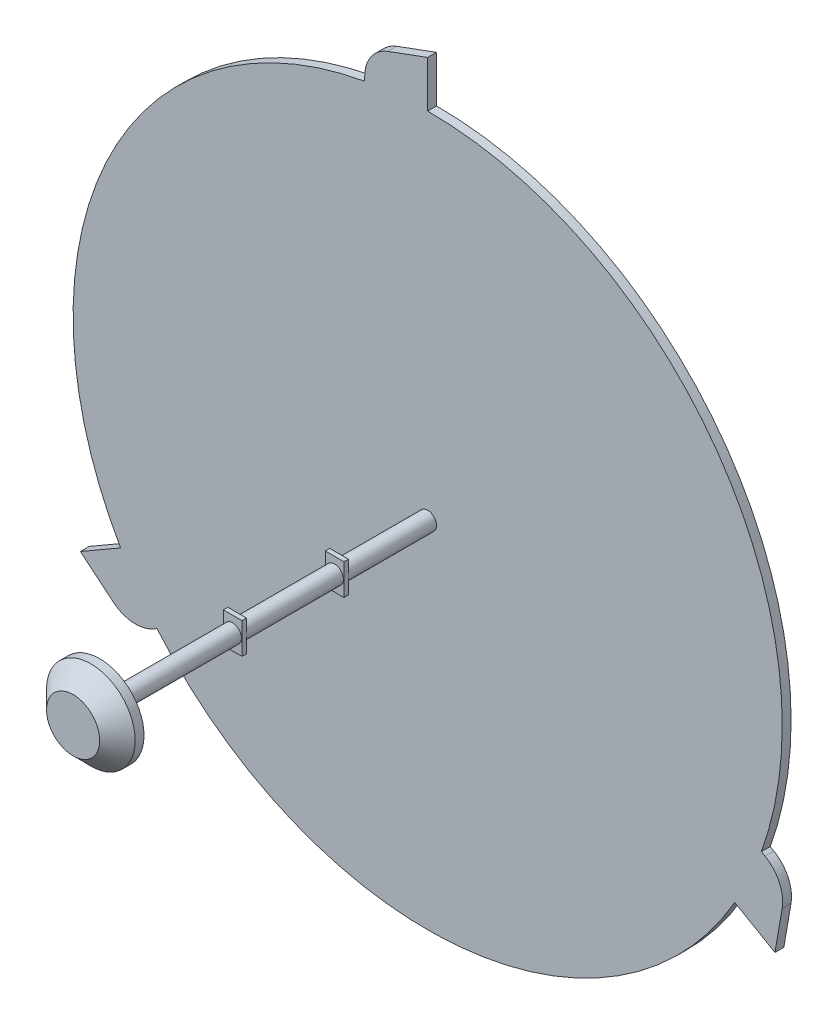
from build123d import *

# Parameters (mm, degrees)
ESQUISSE1_R                        = 10
EXTRUSION1_DEPTH                   = 150
ESQUISSE2_W                        = 21
ESQUISSE2_H                        = 35
EXTRUSION2_DEPTH                   = 5
EXTRUSION3_START                   = 110
ESQUISSE3_R                        = 10
EXTRUSION3_DEPTH                   = 110
ESQUISSE4_W                        = 21
ESQUISSE4_H                        = 35
EXTRUSION4_DEPTH                   = 5
EXTRUSION5_START                   = 100
ESQUISSE5_R                        = 10
EXTRUSION5_DEPTH                   = 100
ESQUISSE7_R                        = 50
EXTRUSION7_DEPTH                   = 30
CHANFREIN2_SIZE                    = 20
ESQUISSE12_R                       = 400
EXTRUSION10_DEPTH                  = 10
EXTRUSION11_DEPTH                  = 10
CONG_1_R                           = 40
R_P_TITION_CIRCULAIRE1_COUNT       = 3
CONG_1_OF_R_P_TITION_CIRCULAIRE1_R = 40


with BuildPart() as part:
    # Esquisse1 → Extrusion1 (new body)
    with BuildSketch(Plane.XY):
        Circle(ESQUISSE1_R)
    extrude(amount=EXTRUSION1_DEPTH)

    # Esquisse2 → Extrusion2 (add)
    with BuildSketch(Plane(origin=(0, 0, 0), x_dir=(-1, 0, 0), z_dir=(0, 0, -1))):
        Rectangle(ESQUISSE2_W, ESQUISSE2_H)
    extrude(amount=EXTRUSION2_DEPTH)

    # Esquisse3 → Extrusion3 (add)
    with BuildSketch(Plane(origin=(0, 0, -5), x_dir=(-1, 0, 0), z_dir=(0, 0, -1)).offset(EXTRUSION3_START)):
        Circle(ESQUISSE3_R)
    extrude(amount=-EXTRUSION3_DEPTH)

    # Esquisse4 → Extrusion4 (add)
    with BuildSketch(Plane(origin=(0, 0, -115), x_dir=(-1, 0, 0), z_dir=(0, 0, -1))):
        Rectangle(ESQUISSE4_W, ESQUISSE4_H)
    extrude(amount=EXTRUSION4_DEPTH)

    # Esquisse5 → Extrusion5 (add)
    with BuildSketch(Plane(origin=(0, 0, -120), x_dir=(-1, 0, 0), z_dir=(0, 0, -1)).offset(EXTRUSION5_START)):
        Circle(ESQUISSE5_R)
    extrude(amount=-EXTRUSION5_DEPTH)

    # Esquisse7 → Extrusion7 (add)
    with BuildSketch(Plane.XY.offset(150)):
        Circle(ESQUISSE7_R)
    extrude(amount=EXTRUSION7_DEPTH)

    # Chanfrein2
    chanfrein2_edges = [part.edges().sort_by_distance(p)[0] for p in [
        (-50, 0, 180),
    ]]
    chamfer(chanfrein2_edges, length=CHANFREIN2_SIZE)

    # Esquisse12 → Extrusion10 (add)
    with BuildSketch(Plane(origin=(0, 0, -220), x_dir=(-1, 0, 0), z_dir=(0, 0, -1))):
        Circle(ESQUISSE12_R)
    extrude(amount=EXTRUSION10_DEPTH)

    # Esquisse13 → Extrusion11 (add)
    with BuildSketch(Plane.XY.offset(-220)):
        with BuildLine():
            Line((0, 400), (0, 452.388982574))
            Line((0, 452.388982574), (-71.051152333, 426.194491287))
            Line((-71.051152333, 426.194491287), (-71.051152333, 393.639090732))
            ThreePointArc((-71.051152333, 393.639090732), (-35.66765837, 398.406599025), (0, 400))
        make_face()
    extrusion11 = extrude(amount=-EXTRUSION11_DEPTH)

    # Cong_1
    cong_1_edges = [part.edges().sort_by_distance(p)[0] for p in [
        (-71.051152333, 426.194491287, -225),
    ]]
    fillet(cong_1_edges, radius=CONG_1_R)

    # R_p_tition circulaire1: Extrusion11 ×3 about axis
    r_p_tition_circulaire1_axis = Axis((0, 0, 0), (0, 0, 1))
    for i in range(1, R_P_TITION_CIRCULAIRE1_COUNT):
        add(extrusion11.rotate(r_p_tition_circulaire1_axis, i * 360 / R_P_TITION_CIRCULAIRE1_COUNT))

    # Cong_1 of R_p_tition circulaire1
    cong_1_of_r_p_tition_circulaire1_edges = [part.edges().sort_by_distance(p)[0] for p in [
        (-333.569680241, -274.629348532, -225),
        (404.620832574, -151.565142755, -225),
    ]]
    fillet(cong_1_of_r_p_tition_circulaire1_edges, radius=CONG_1_OF_R_P_TITION_CIRCULAIRE1_R)


solid = part.part
